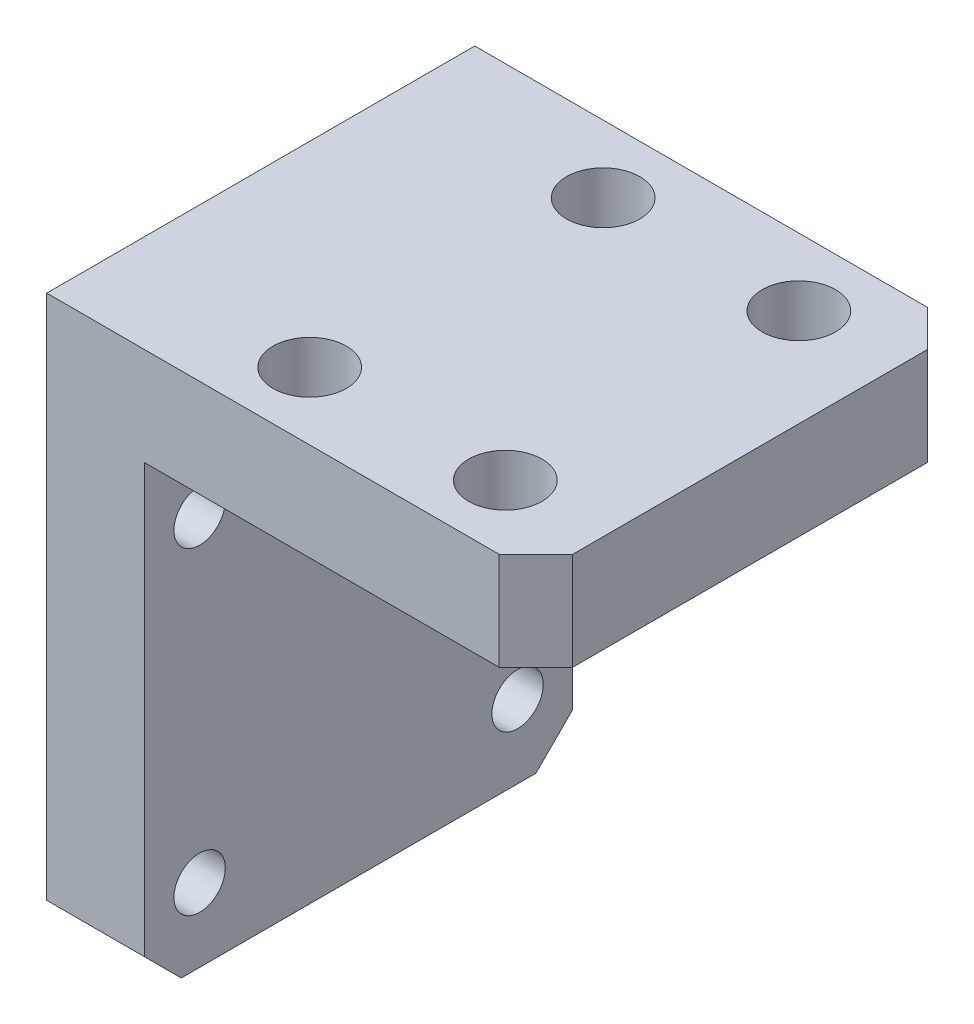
from build123d import *

# Parameters (mm, degrees)
EXTRUDE_2_DEPTH         = 35
SKETCH_3_R              = 3
CUT_EXTRUDE_1_DEPTH     = 71.292247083
ESQUISSE1_R             = 2.1
ENL_V_MAT_EXTRU_1_DEPTH = 66.337584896
CHANFREIN1_SIZE         = 3


with BuildPart() as part:
    # Sketch 2 → Extrude 2 (new body)
    with BuildSketch(Plane.XY):
        Polygon((-32, 0), (0, 0), (0, 8), (-40, 8), (-40, -38), (-32, -38), align=None)
    extrude(amount=EXTRUDE_2_DEPTH)

    # Sketch 3 → Cut-Extrude 1 (cut, through all)
    with BuildSketch(Plane(origin=(0, 8, 0), x_dir=(1, 0, 0), z_dir=(0, 1, 0))):
        with Locations(Location((-8, -29.5, 0), (0, 0, 270))):
            Circle(SKETCH_3_R)
        with Locations(Location((-24, -29.5, 0), (0, 0, 270))):
            Circle(SKETCH_3_R)
        with Locations(Location((-8, -5.5, 0), (0, 0, 270))):
            Circle(SKETCH_3_R)
        with Locations(Location((-24, -5.5, 0), (0, 0, 270))):
            Circle(SKETCH_3_R)
    extrude(amount=-CUT_EXTRUDE_1_DEPTH, mode=Mode.SUBTRACT)

    # Esquisse1 → Enl_v. mat.-Extru.1 (cut, through all)
    with BuildSketch(Plane.ZY.offset(40)):
        with Locations((4.5, -32)):
            Circle(ESQUISSE1_R)
        with Locations(Location((30.5, -32, 0), (0, 0, 270))):
            Circle(ESQUISSE1_R)
        with Locations((30.5, -6)):
            Circle(ESQUISSE1_R)
        with Locations(Location((4.5, -6, 0), (0, 0, 270))):
            Circle(ESQUISSE1_R)
    extrude(amount=-ENL_V_MAT_EXTRU_1_DEPTH, mode=Mode.SUBTRACT)

    # Chanfrein1
    chanfrein1_edges = [part.edges().sort_by_distance(p)[0] for p in [
        (-36, -38, 35),
        (0, 4, 35),
        (-36, -38, 0),
        (0, 4, 0),
    ]]
    chamfer(chanfrein1_edges, length=CHANFREIN1_SIZE)


solid = part.part
